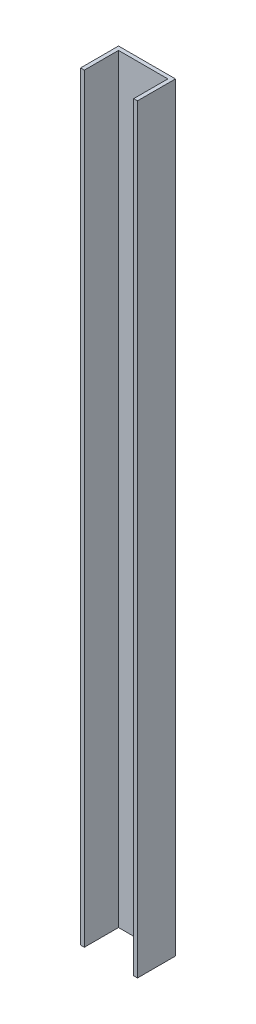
ISO-10303-21;
HEADER;
FILE_DESCRIPTION(('STEP AP214'),'2;1');
FILE_NAME('part.step','',(''),(''),'','','');
FILE_SCHEMA(('AUTOMOTIVE_DESIGN { 1 0 10303 214 1 1 1 1 }'));
ENDSEC;
DATA;
#1=APPLICATION_CONTEXT('core data for automotive mechanical design processes');
#2=APPLICATION_PROTOCOL_DEFINITION('international standard','automotive_design',2000,#1);
#3=PRODUCT_CONTEXT('',#1,'mechanical');
#4=PRODUCT('Part','Part','',(#3));
#5=PRODUCT_RELATED_PRODUCT_CATEGORY('part','',(#4));
#6=PRODUCT_DEFINITION_FORMATION('','',#4);
#7=PRODUCT_DEFINITION_CONTEXT('part definition',#1,'design');
#8=PRODUCT_DEFINITION('design','',#6,#7);
#9=PRODUCT_DEFINITION_SHAPE('','',#8);
#10=(LENGTH_UNIT() NAMED_UNIT(*) SI_UNIT(.MILLI.,.METRE.));
#11=(NAMED_UNIT(*) PLANE_ANGLE_UNIT() SI_UNIT($,.RADIAN.));
#12=(NAMED_UNIT(*) SI_UNIT($,.STERADIAN.) SOLID_ANGLE_UNIT());
#13=UNCERTAINTY_MEASURE_WITH_UNIT(LENGTH_MEASURE(1.E-05),#10,'distance_accuracy_value','');
#14=(GEOMETRIC_REPRESENTATION_CONTEXT(3) GLOBAL_UNCERTAINTY_ASSIGNED_CONTEXT((#13)) GLOBAL_UNIT_ASSIGNED_CONTEXT((#10,
#11,#12)) REPRESENTATION_CONTEXT('',''));
#15=CARTESIAN_POINT('',(0.,0.,0.));
#16=DIRECTION('',(0.,0.,1.));
#17=DIRECTION('',(1.,0.,0.));
#18=AXIS2_PLACEMENT_3D('',#15,#16,#17);
#19=CARTESIAN_POINT('',(0.,200.,10.));
#20=DIRECTION('',(0.,0.,-1.));
#21=DIRECTION('',(-1.,0.,0.));
#22=AXIS2_PLACEMENT_3D('',#19,#20,#21);
#23=PLANE('',#22);
#24=DIRECTION('',(1.,0.,0.));
#25=VECTOR('',#24,1.);
#26=CARTESIAN_POINT('',(0.,0.,10.));
#27=LINE('',#26,#25);
#28=CARTESIAN_POINT('',(0.,0.,10.));
#29=VERTEX_POINT('',#28);
#30=CARTESIAN_POINT('',(1.,0.,10.));
#31=VERTEX_POINT('',#30);
#32=EDGE_CURVE('E85',#29,#31,#27,.T.);
#33=ORIENTED_EDGE('',*,*,#32,.T.);
#34=DIRECTION('',(0.,1.,0.));
#35=VECTOR('',#34,1.);
#36=CARTESIAN_POINT('',(1.,0.,10.));
#37=LINE('',#36,#35);
#38=CARTESIAN_POINT('',(1.,200.,10.));
#39=VERTEX_POINT('',#38);
#40=EDGE_CURVE('E107',#31,#39,#37,.T.);
#41=ORIENTED_EDGE('',*,*,#40,.T.);
#42=DIRECTION('',(-1.,0.,0.));
#43=VECTOR('',#42,1.);
#44=CARTESIAN_POINT('',(0.,200.,10.));
#45=LINE('',#44,#43);
#46=CARTESIAN_POINT('',(0.,200.,10.));
#47=VERTEX_POINT('',#46);
#48=EDGE_CURVE('E56',#39,#47,#45,.T.);
#49=ORIENTED_EDGE('',*,*,#48,.T.);
#50=DIRECTION('',(0.,-1.,0.));
#51=VECTOR('',#50,1.);
#52=CARTESIAN_POINT('',(0.,0.,10.));
#53=LINE('',#52,#51);
#54=EDGE_CURVE('E121',#47,#29,#53,.T.);
#55=ORIENTED_EDGE('',*,*,#54,.T.);
#56=EDGE_LOOP('',(#33,#41,#49,#55));
#57=FACE_BOUND('',#56,.T.);
#58=ADVANCED_FACE('F32',(#57),#23,.F.);
#59=CARTESIAN_POINT('',(0.,0.,10.));
#60=DIRECTION('',(1.,0.,0.));
#61=DIRECTION('',(0.,0.,-1.));
#62=AXIS2_PLACEMENT_3D('',#59,#60,#61);
#63=PLANE('',#62);
#64=DIRECTION('',(0.,-1.,0.));
#65=VECTOR('',#64,1.);
#66=CARTESIAN_POINT('',(0.,0.,0.));
#67=LINE('',#66,#65);
#68=CARTESIAN_POINT('',(0.,200.,0.));
#69=VERTEX_POINT('',#68);
#70=CARTESIAN_POINT('',(0.,0.,0.));
#71=VERTEX_POINT('',#70);
#72=EDGE_CURVE('E133',#69,#71,#67,.T.);
#73=ORIENTED_EDGE('',*,*,#72,.T.);
#74=DIRECTION('',(0.,0.,-1.));
#75=VECTOR('',#74,1.);
#76=CARTESIAN_POINT('',(0.,0.,10.));
#77=LINE('',#76,#75);
#78=EDGE_CURVE('E11',#29,#71,#77,.T.);
#79=ORIENTED_EDGE('',*,*,#78,.F.);
#80=ORIENTED_EDGE('',*,*,#54,.F.);
#81=DIRECTION('',(0.,0.,-1.));
#82=VECTOR('',#81,1.);
#83=CARTESIAN_POINT('',(0.,200.,10.));
#84=LINE('',#83,#82);
#85=EDGE_CURVE('E132',#47,#69,#84,.T.);
#86=ORIENTED_EDGE('',*,*,#85,.T.);
#87=EDGE_LOOP('',(#73,#79,#80,#86));
#88=FACE_BOUND('',#87,.T.);
#89=ADVANCED_FACE('F34',(#88),#63,.F.);
#90=CARTESIAN_POINT('',(0.,0.,10.));
#91=DIRECTION('',(0.,1.,0.));
#92=DIRECTION('',(0.,0.,1.));
#93=AXIS2_PLACEMENT_3D('',#90,#91,#92);
#94=PLANE('',#93);
#95=DIRECTION('',(-1.,0.,0.));
#96=VECTOR('',#95,1.);
#97=CARTESIAN_POINT('',(1.,0.,1.));
#98=LINE('',#97,#96);
#99=CARTESIAN_POINT('',(14.,0.,1.));
#100=VERTEX_POINT('',#99);
#101=CARTESIAN_POINT('',(1.,0.,1.));
#102=VERTEX_POINT('',#101);
#103=EDGE_CURVE('E114',#100,#102,#98,.T.);
#104=ORIENTED_EDGE('',*,*,#103,.T.);
#105=DIRECTION('',(0.,0.,1.));
#106=VECTOR('',#105,1.);
#107=CARTESIAN_POINT('',(1.,0.,10.));
#108=LINE('',#107,#106);
#109=EDGE_CURVE('E109',#102,#31,#108,.T.);
#110=ORIENTED_EDGE('',*,*,#109,.T.);
#111=ORIENTED_EDGE('',*,*,#32,.F.);
#112=ORIENTED_EDGE('',*,*,#78,.T.);
#113=DIRECTION('',(1.,0.,0.));
#114=VECTOR('',#113,1.);
#115=CARTESIAN_POINT('',(0.,0.,0.));
#116=LINE('',#115,#114);
#117=CARTESIAN_POINT('',(15.,0.,0.));
#118=VERTEX_POINT('',#117);
#119=EDGE_CURVE('E136',#71,#118,#116,.T.);
#120=ORIENTED_EDGE('',*,*,#119,.T.);
#121=DIRECTION('',(0.,0.,-1.));
#122=VECTOR('',#121,1.);
#123=CARTESIAN_POINT('',(15.,0.,10.));
#124=LINE('',#123,#122);
#125=CARTESIAN_POINT('',(15.,0.,10.));
#126=VERTEX_POINT('',#125);
#127=EDGE_CURVE('E40',#126,#118,#124,.T.);
#128=ORIENTED_EDGE('',*,*,#127,.F.);
#129=CARTESIAN_POINT('',(14.,0.,10.));
#130=VERTEX_POINT('',#129);
#131=EDGE_CURVE('E124',#130,#126,#27,.T.);
#132=ORIENTED_EDGE('',*,*,#131,.F.);
#133=DIRECTION('',(0.,0.,-1.));
#134=VECTOR('',#133,1.);
#135=CARTESIAN_POINT('',(14.,0.,10.));
#136=LINE('',#135,#134);
#137=EDGE_CURVE('E47',#130,#100,#136,.T.);
#138=ORIENTED_EDGE('',*,*,#137,.T.);
#139=EDGE_LOOP('',(#104,#110,#111,#112,#120,#128,#132,#138));
#140=FACE_BOUND('',#139,.T.);
#141=ADVANCED_FACE('F116',(#140),#94,.F.);
#142=CARTESIAN_POINT('',(15.,0.,10.));
#143=DIRECTION('',(-1.,0.,0.));
#144=DIRECTION('',(0.,0.,1.));
#145=AXIS2_PLACEMENT_3D('',#142,#143,#144);
#146=PLANE('',#145);
#147=DIRECTION('',(0.,1.,0.));
#148=VECTOR('',#147,1.);
#149=CARTESIAN_POINT('',(15.,0.,0.));
#150=LINE('',#149,#148);
#151=CARTESIAN_POINT('',(15.,200.,0.));
#152=VERTEX_POINT('',#151);
#153=EDGE_CURVE('E139',#118,#152,#150,.T.);
#154=ORIENTED_EDGE('',*,*,#153,.T.);
#155=DIRECTION('',(0.,0.,-1.));
#156=VECTOR('',#155,1.);
#157=CARTESIAN_POINT('',(15.,200.,10.));
#158=LINE('',#157,#156);
#159=CARTESIAN_POINT('',(15.,200.,10.));
#160=VERTEX_POINT('',#159);
#161=EDGE_CURVE('E143',#160,#152,#158,.T.);
#162=ORIENTED_EDGE('',*,*,#161,.F.);
#163=DIRECTION('',(0.,1.,0.));
#164=VECTOR('',#163,1.);
#165=CARTESIAN_POINT('',(15.,0.,10.));
#166=LINE('',#165,#164);
#167=EDGE_CURVE('E123',#126,#160,#166,.T.);
#168=ORIENTED_EDGE('',*,*,#167,.F.);
#169=ORIENTED_EDGE('',*,*,#127,.T.);
#170=EDGE_LOOP('',(#154,#162,#168,#169));
#171=FACE_BOUND('',#170,.T.);
#172=ADVANCED_FACE('F149',(#171),#146,.F.);
#173=CARTESIAN_POINT('',(0.,200.,10.));
#174=DIRECTION('',(0.,-1.,0.));
#175=DIRECTION('',(0.,0.,-1.));
#176=AXIS2_PLACEMENT_3D('',#173,#174,#175);
#177=PLANE('',#176);
#178=ORIENTED_EDGE('',*,*,#48,.F.);
#179=DIRECTION('',(0.,0.,1.));
#180=VECTOR('',#179,1.);
#181=CARTESIAN_POINT('',(1.,200.,10.));
#182=LINE('',#181,#180);
#183=CARTESIAN_POINT('',(1.,200.,1.));
#184=VERTEX_POINT('',#183);
#185=EDGE_CURVE('E112',#184,#39,#182,.T.);
#186=ORIENTED_EDGE('',*,*,#185,.F.);
#187=DIRECTION('',(-1.,0.,0.));
#188=VECTOR('',#187,1.);
#189=CARTESIAN_POINT('',(1.,200.,1.));
#190=LINE('',#189,#188);
#191=CARTESIAN_POINT('',(14.,200.,1.));
#192=VERTEX_POINT('',#191);
#193=EDGE_CURVE('E118',#192,#184,#190,.T.);
#194=ORIENTED_EDGE('',*,*,#193,.F.);
#195=DIRECTION('',(0.,0.,-1.));
#196=VECTOR('',#195,1.);
#197=CARTESIAN_POINT('',(14.,200.,10.));
#198=LINE('',#197,#196);
#199=CARTESIAN_POINT('',(14.,200.,10.));
#200=VERTEX_POINT('',#199);
#201=EDGE_CURVE('E160',#200,#192,#198,.T.);
#202=ORIENTED_EDGE('',*,*,#201,.F.);
#203=EDGE_CURVE('E129',#160,#200,#45,.T.);
#204=ORIENTED_EDGE('',*,*,#203,.F.);
#205=ORIENTED_EDGE('',*,*,#161,.T.);
#206=DIRECTION('',(-1.,0.,0.));
#207=VECTOR('',#206,1.);
#208=CARTESIAN_POINT('',(0.,200.,0.));
#209=LINE('',#208,#207);
#210=EDGE_CURVE('E78',#152,#69,#209,.T.);
#211=ORIENTED_EDGE('',*,*,#210,.T.);
#212=ORIENTED_EDGE('',*,*,#85,.F.);
#213=EDGE_LOOP('',(#178,#186,#194,#202,#204,#205,#211,#212));
#214=FACE_BOUND('',#213,.T.);
#215=ADVANCED_FACE('F156',(#214),#177,.F.);
#216=ORIENTED_EDGE('',*,*,#203,.T.);
#217=DIRECTION('',(0.,1.,0.));
#218=VECTOR('',#217,1.);
#219=CARTESIAN_POINT('',(14.,0.,10.));
#220=LINE('',#219,#218);
#221=EDGE_CURVE('E113',#130,#200,#220,.T.);
#222=ORIENTED_EDGE('',*,*,#221,.F.);
#223=ORIENTED_EDGE('',*,*,#131,.T.);
#224=ORIENTED_EDGE('',*,*,#167,.T.);
#225=EDGE_LOOP('',(#216,#222,#223,#224));
#226=FACE_BOUND('',#225,.T.);
#227=ADVANCED_FACE('F174',(#226),#23,.F.);
#228=CARTESIAN_POINT('',(0.,200.,0.));
#229=DIRECTION('',(0.,0.,-1.));
#230=DIRECTION('',(-1.,0.,0.));
#231=AXIS2_PLACEMENT_3D('',#228,#229,#230);
#232=PLANE('',#231);
#233=ORIENTED_EDGE('',*,*,#72,.F.);
#234=ORIENTED_EDGE('',*,*,#210,.F.);
#235=ORIENTED_EDGE('',*,*,#153,.F.);
#236=ORIENTED_EDGE('',*,*,#119,.F.);
#237=EDGE_LOOP('',(#233,#234,#235,#236));
#238=FACE_BOUND('',#237,.T.);
#239=ADVANCED_FACE('F154',(#238),#232,.T.);
#240=CARTESIAN_POINT('',(1.,0.,10.));
#241=DIRECTION('',(-1.,0.,0.));
#242=DIRECTION('',(0.,0.,1.));
#243=AXIS2_PLACEMENT_3D('',#240,#241,#242);
#244=PLANE('',#243);
#245=ORIENTED_EDGE('',*,*,#185,.T.);
#246=ORIENTED_EDGE('',*,*,#40,.F.);
#247=ORIENTED_EDGE('',*,*,#109,.F.);
#248=DIRECTION('',(0.,1.,0.));
#249=VECTOR('',#248,1.);
#250=CARTESIAN_POINT('',(1.,0.,1.));
#251=LINE('',#250,#249);
#252=EDGE_CURVE('E137',#102,#184,#251,.T.);
#253=ORIENTED_EDGE('',*,*,#252,.T.);
#254=EDGE_LOOP('',(#245,#246,#247,#253));
#255=FACE_BOUND('',#254,.T.);
#256=ADVANCED_FACE('F108',(#255),#244,.F.);
#257=CARTESIAN_POINT('',(1.,0.,1.));
#258=DIRECTION('',(0.,0.,-1.));
#259=DIRECTION('',(-1.,0.,0.));
#260=AXIS2_PLACEMENT_3D('',#257,#258,#259);
#261=PLANE('',#260);
#262=ORIENTED_EDGE('',*,*,#193,.T.);
#263=ORIENTED_EDGE('',*,*,#252,.F.);
#264=ORIENTED_EDGE('',*,*,#103,.F.);
#265=DIRECTION('',(0.,1.,0.));
#266=VECTOR('',#265,1.);
#267=CARTESIAN_POINT('',(14.,0.,1.));
#268=LINE('',#267,#266);
#269=EDGE_CURVE('E169',#100,#192,#268,.T.);
#270=ORIENTED_EDGE('',*,*,#269,.T.);
#271=EDGE_LOOP('',(#262,#263,#264,#270));
#272=FACE_BOUND('',#271,.T.);
#273=ADVANCED_FACE('F219',(#272),#261,.F.);
#274=CARTESIAN_POINT('',(14.,0.,10.));
#275=DIRECTION('',(1.,0.,0.));
#276=DIRECTION('',(0.,0.,-1.));
#277=AXIS2_PLACEMENT_3D('',#274,#275,#276);
#278=PLANE('',#277);
#279=ORIENTED_EDGE('',*,*,#201,.T.);
#280=ORIENTED_EDGE('',*,*,#269,.F.);
#281=ORIENTED_EDGE('',*,*,#137,.F.);
#282=ORIENTED_EDGE('',*,*,#221,.T.);
#283=EDGE_LOOP('',(#279,#280,#281,#282));
#284=FACE_BOUND('',#283,.T.);
#285=ADVANCED_FACE('F171',(#284),#278,.F.);
#286=CLOSED_SHELL('',(#58,#89,#141,#172,#215,#227,#239,#256,#273,#285));
#287=MANIFOLD_SOLID_BREP('B2',#286);
#288=ADVANCED_BREP_SHAPE_REPRESENTATION('',(#18,#287),#14);
#289=SHAPE_DEFINITION_REPRESENTATION(#9,#288);
ENDSEC;
END-ISO-10303-21;
